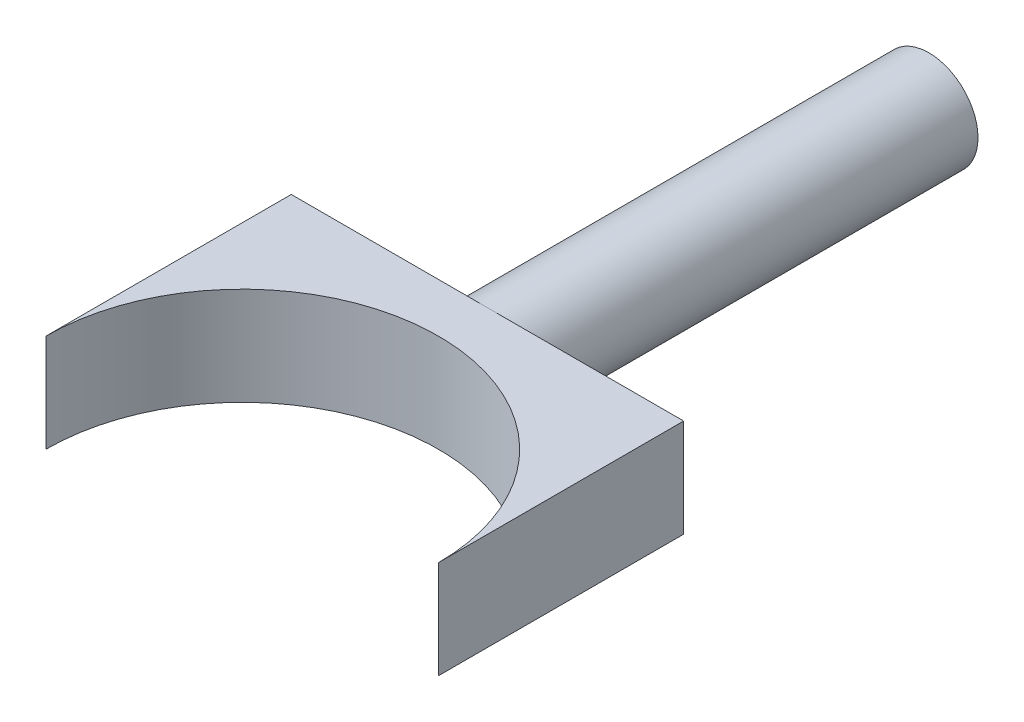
ISO-10303-21;
HEADER;
FILE_DESCRIPTION(('STEP AP214'),'2;1');
FILE_NAME('part.step','',(''),(''),'','','');
FILE_SCHEMA(('AUTOMOTIVE_DESIGN { 1 0 10303 214 1 1 1 1 }'));
ENDSEC;
DATA;
#1=APPLICATION_CONTEXT('core data for automotive mechanical design processes');
#2=APPLICATION_PROTOCOL_DEFINITION('international standard','automotive_design',2000,#1);
#3=PRODUCT_CONTEXT('',#1,'mechanical');
#4=PRODUCT('Part','Part','',(#3));
#5=PRODUCT_RELATED_PRODUCT_CATEGORY('part','',(#4));
#6=PRODUCT_DEFINITION_FORMATION('','',#4);
#7=PRODUCT_DEFINITION_CONTEXT('part definition',#1,'design');
#8=PRODUCT_DEFINITION('design','',#6,#7);
#9=PRODUCT_DEFINITION_SHAPE('','',#8);
#10=(LENGTH_UNIT() NAMED_UNIT(*) SI_UNIT(.MILLI.,.METRE.));
#11=(NAMED_UNIT(*) PLANE_ANGLE_UNIT() SI_UNIT($,.RADIAN.));
#12=(NAMED_UNIT(*) SI_UNIT($,.STERADIAN.) SOLID_ANGLE_UNIT());
#13=UNCERTAINTY_MEASURE_WITH_UNIT(LENGTH_MEASURE(1.E-05),#10,'distance_accuracy_value','');
#14=(GEOMETRIC_REPRESENTATION_CONTEXT(3) GLOBAL_UNCERTAINTY_ASSIGNED_CONTEXT((#13)) GLOBAL_UNIT_ASSIGNED_CONTEXT((#10,
#11,#12)) REPRESENTATION_CONTEXT('',''));
#15=CARTESIAN_POINT('',(0.,0.,0.));
#16=DIRECTION('',(0.,0.,1.));
#17=DIRECTION('',(1.,0.,0.));
#18=AXIS2_PLACEMENT_3D('',#15,#16,#17);
#19=CARTESIAN_POINT('',(0.,0.,45.));
#20=DIRECTION('',(0.,0.,-1.));
#21=DIRECTION('',(-1.,0.,0.));
#22=AXIS2_PLACEMENT_3D('',#19,#20,#21);
#23=CYLINDRICAL_SURFACE('',#22,5.);
#24=CARTESIAN_POINT('',(0.213209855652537,4.99545208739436,45.));
#25=DIRECTION('',(-1.,0.,0.));
#26=VECTOR('',#25,1.);
#27=LINE('',#24,#26);
#28=CARTESIAN_POINT('',(0.213209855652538,4.99545208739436,45.));
#29=VERTEX_POINT('',#28);
#30=CARTESIAN_POINT('',(-0.213209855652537,4.99545208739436,45.));
#31=VERTEX_POINT('',#30);
#32=EDGE_CURVE('E42',#29,#31,#27,.T.);
#33=ORIENTED_EDGE('',*,*,#32,.F.);
#34=CARTESIAN_POINT('',(0.,0.,45.));
#35=DIRECTION('',(0.,0.,1.));
#36=DIRECTION('',(1.,0.,0.));
#37=AXIS2_PLACEMENT_3D('',#34,#35,#36);
#38=CIRCLE('',#37,5.);
#39=CARTESIAN_POINT('',(0.213209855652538,-4.99545208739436,45.));
#40=VERTEX_POINT('',#39);
#41=EDGE_CURVE('E49',#40,#29,#38,.T.);
#42=ORIENTED_EDGE('',*,*,#41,.F.);
#43=CARTESIAN_POINT('',(-0.213209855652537,-4.99545208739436,45.));
#44=DIRECTION('',(1.,0.,0.));
#45=VECTOR('',#44,1.);
#46=LINE('',#43,#45);
#47=CARTESIAN_POINT('',(-0.213209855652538,-4.99545208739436,45.));
#48=VERTEX_POINT('',#47);
#49=EDGE_CURVE('E11',#48,#40,#46,.T.);
#50=ORIENTED_EDGE('',*,*,#49,.F.);
#51=EDGE_CURVE('E177',#31,#48,#38,.T.);
#52=ORIENTED_EDGE('',*,*,#51,.F.);
#53=EDGE_LOOP('',(#33,#42,#50,#52));
#54=FACE_BOUND('',#53,.T.);
#55=CARTESIAN_POINT('',(0.,0.,0.));
#56=DIRECTION('',(0.,0.,1.));
#57=DIRECTION('',(1.,0.,0.));
#58=AXIS2_PLACEMENT_3D('',#55,#56,#57);
#59=CIRCLE('',#58,5.);
#60=CARTESIAN_POINT('',(5.,0.,0.));
#61=VERTEX_POINT('',#60);
#62=EDGE_CURVE('E167',#61,#61,#59,.T.);
#63=ORIENTED_EDGE('',*,*,#62,.T.);
#64=EDGE_LOOP('',(#63));
#65=FACE_BOUND('',#64,.T.);
#66=ADVANCED_FACE('F32',(#54,#65),#23,.T.);
#67=CARTESIAN_POINT('',(0.,0.,0.));
#68=DIRECTION('',(0.,0.,1.));
#69=DIRECTION('',(1.,0.,0.));
#70=AXIS2_PLACEMENT_3D('',#67,#68,#69);
#71=PLANE('',#70);
#72=ORIENTED_EDGE('',*,*,#62,.F.);
#73=EDGE_LOOP('',(#72));
#74=FACE_BOUND('',#73,.T.);
#75=ADVANCED_FACE('F197',(#74),#71,.F.);
#76=CARTESIAN_POINT('',(0.,0.,45.));
#77=DIRECTION('',(0.,0.,-1.));
#78=DIRECTION('',(-1.,0.,0.));
#79=AXIS2_PLACEMENT_3D('',#76,#77,#78);
#80=PLANE('',#79);
#81=DIRECTION('',(-1.,0.,0.));
#82=VECTOR('',#81,1.);
#83=CARTESIAN_POINT('',(-20.,4.99545208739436,45.));
#84=LINE('',#83,#82);
#85=CARTESIAN_POINT('',(-20.,4.99545208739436,45.));
#86=VERTEX_POINT('',#85);
#87=EDGE_CURVE('E101',#31,#86,#84,.T.);
#88=ORIENTED_EDGE('',*,*,#87,.F.);
#89=ORIENTED_EDGE('',*,*,#51,.T.);
#90=DIRECTION('',(1.,0.,0.));
#91=VECTOR('',#90,1.);
#92=CARTESIAN_POINT('',(-20.,-4.99545208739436,45.));
#93=LINE('',#92,#91);
#94=CARTESIAN_POINT('',(-20.,-4.99545208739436,45.));
#95=VERTEX_POINT('',#94);
#96=EDGE_CURVE('E114',#95,#48,#93,.T.);
#97=ORIENTED_EDGE('',*,*,#96,.F.);
#98=DIRECTION('',(0.,-1.,0.));
#99=VECTOR('',#98,1.);
#100=CARTESIAN_POINT('',(-20.,-4.99545208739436,45.));
#101=LINE('',#100,#99);
#102=EDGE_CURVE('E123',#86,#95,#101,.T.);
#103=ORIENTED_EDGE('',*,*,#102,.F.);
#104=EDGE_LOOP('',(#88,#89,#97,#103));
#105=FACE_BOUND('',#104,.T.);
#106=ADVANCED_FACE('F195',(#105),#80,.T.);
#107=CARTESIAN_POINT('',(20.,-4.99545208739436,70.));
#108=DIRECTION('',(-1.,0.,0.));
#109=DIRECTION('',(0.,0.,1.));
#110=AXIS2_PLACEMENT_3D('',#107,#108,#109);
#111=PLANE('',#110);
#112=DIRECTION('',(0.,1.,0.));
#113=VECTOR('',#112,1.);
#114=CARTESIAN_POINT('',(20.,-4.99545208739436,45.));
#115=LINE('',#114,#113);
#116=CARTESIAN_POINT('',(20.,-4.99545208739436,45.));
#117=VERTEX_POINT('',#116);
#118=CARTESIAN_POINT('',(20.,4.99545208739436,45.));
#119=VERTEX_POINT('',#118);
#120=EDGE_CURVE('E118',#117,#119,#115,.T.);
#121=ORIENTED_EDGE('',*,*,#120,.T.);
#122=DIRECTION('',(0.,0.,-1.));
#123=VECTOR('',#122,1.);
#124=CARTESIAN_POINT('',(20.,4.99545208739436,70.));
#125=LINE('',#124,#123);
#126=CARTESIAN_POINT('',(20.,4.99545208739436,70.));
#127=VERTEX_POINT('',#126);
#128=EDGE_CURVE('E104',#127,#119,#125,.T.);
#129=ORIENTED_EDGE('',*,*,#128,.F.);
#130=DIRECTION('',(0.,1.,0.));
#131=VECTOR('',#130,1.);
#132=CARTESIAN_POINT('',(20.,-4.99545208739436,70.));
#133=LINE('',#132,#131);
#134=CARTESIAN_POINT('',(20.,-4.99545208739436,70.));
#135=VERTEX_POINT('',#134);
#136=EDGE_CURVE('E90',#135,#127,#133,.T.);
#137=ORIENTED_EDGE('',*,*,#136,.F.);
#138=DIRECTION('',(0.,0.,-1.));
#139=VECTOR('',#138,1.);
#140=CARTESIAN_POINT('',(20.,-4.99545208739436,70.));
#141=LINE('',#140,#139);
#142=EDGE_CURVE('E110',#135,#117,#141,.T.);
#143=ORIENTED_EDGE('',*,*,#142,.T.);
#144=EDGE_LOOP('',(#121,#129,#137,#143));
#145=FACE_BOUND('',#144,.T.);
#146=ADVANCED_FACE('F156',(#145),#111,.F.);
#147=CARTESIAN_POINT('',(-20.,4.99545208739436,70.));
#148=DIRECTION('',(0.,-1.,0.));
#149=DIRECTION('',(0.,0.,-1.));
#150=AXIS2_PLACEMENT_3D('',#147,#148,#149);
#151=PLANE('',#150);
#152=DIRECTION('',(0.,0.,-1.));
#153=VECTOR('',#152,1.);
#154=CARTESIAN_POINT('',(-20.,4.99545208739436,70.));
#155=LINE('',#154,#153);
#156=CARTESIAN_POINT('',(-20.,4.99545208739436,70.));
#157=VERTEX_POINT('',#156);
#158=EDGE_CURVE('E97',#157,#86,#155,.T.);
#159=ORIENTED_EDGE('',*,*,#158,.F.);
#160=CARTESIAN_POINT('',(0.,4.99545208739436,70.));
#161=DIRECTION('',(0.,1.,0.));
#162=DIRECTION('',(0.,0.,1.));
#163=AXIS2_PLACEMENT_3D('',#160,#161,#162);
#164=CIRCLE('',#163,20.);
#165=EDGE_CURVE('E83',#127,#157,#164,.T.);
#166=ORIENTED_EDGE('',*,*,#165,.F.);
#167=ORIENTED_EDGE('',*,*,#128,.T.);
#168=EDGE_CURVE('E127',#119,#29,#84,.T.);
#169=ORIENTED_EDGE('',*,*,#168,.T.);
#170=ORIENTED_EDGE('',*,*,#32,.T.);
#171=ORIENTED_EDGE('',*,*,#87,.T.);
#172=EDGE_LOOP('',(#159,#166,#167,#169,#170,#171));
#173=FACE_BOUND('',#172,.T.);
#174=ADVANCED_FACE('F98',(#173),#151,.F.);
#175=CARTESIAN_POINT('',(-20.,-4.99545208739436,70.));
#176=DIRECTION('',(1.,0.,0.));
#177=DIRECTION('',(0.,0.,-1.));
#178=AXIS2_PLACEMENT_3D('',#175,#176,#177);
#179=PLANE('',#178);
#180=ORIENTED_EDGE('',*,*,#102,.T.);
#181=DIRECTION('',(0.,0.,-1.));
#182=VECTOR('',#181,1.);
#183=CARTESIAN_POINT('',(-20.,-4.99545208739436,70.));
#184=LINE('',#183,#182);
#185=CARTESIAN_POINT('',(-20.,-4.99545208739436,70.));
#186=VERTEX_POINT('',#185);
#187=EDGE_CURVE('E105',#186,#95,#184,.T.);
#188=ORIENTED_EDGE('',*,*,#187,.F.);
#189=DIRECTION('',(0.,-1.,0.));
#190=VECTOR('',#189,1.);
#191=CARTESIAN_POINT('',(-20.,-4.99545208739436,70.));
#192=LINE('',#191,#190);
#193=EDGE_CURVE('E87',#157,#186,#192,.T.);
#194=ORIENTED_EDGE('',*,*,#193,.F.);
#195=ORIENTED_EDGE('',*,*,#158,.T.);
#196=EDGE_LOOP('',(#180,#188,#194,#195));
#197=FACE_BOUND('',#196,.T.);
#198=ADVANCED_FACE('F108',(#197),#179,.F.);
#199=CARTESIAN_POINT('',(-20.,-4.99545208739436,70.));
#200=DIRECTION('',(0.,1.,0.));
#201=DIRECTION('',(0.,0.,1.));
#202=AXIS2_PLACEMENT_3D('',#199,#200,#201);
#203=PLANE('',#202);
#204=ORIENTED_EDGE('',*,*,#142,.F.);
#205=CARTESIAN_POINT('',(0.,-4.99545208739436,70.));
#206=DIRECTION('',(0.,1.,0.));
#207=DIRECTION('',(0.,0.,1.));
#208=AXIS2_PLACEMENT_3D('',#205,#206,#207);
#209=CIRCLE('',#208,20.);
#210=EDGE_CURVE('E94',#135,#186,#209,.T.);
#211=ORIENTED_EDGE('',*,*,#210,.T.);
#212=ORIENTED_EDGE('',*,*,#187,.T.);
#213=ORIENTED_EDGE('',*,*,#96,.T.);
#214=ORIENTED_EDGE('',*,*,#49,.T.);
#215=EDGE_CURVE('E171',#40,#117,#93,.T.);
#216=ORIENTED_EDGE('',*,*,#215,.T.);
#217=EDGE_LOOP('',(#204,#211,#212,#213,#214,#216));
#218=FACE_BOUND('',#217,.T.);
#219=ADVANCED_FACE('F139',(#218),#203,.F.);
#220=ORIENTED_EDGE('',*,*,#215,.F.);
#221=ORIENTED_EDGE('',*,*,#41,.T.);
#222=ORIENTED_EDGE('',*,*,#168,.F.);
#223=ORIENTED_EDGE('',*,*,#120,.F.);
#224=EDGE_LOOP('',(#220,#221,#222,#223));
#225=FACE_BOUND('',#224,.T.);
#226=ADVANCED_FACE('F149',(#225),#80,.T.);
#227=CARTESIAN_POINT('',(0.,-5.02942928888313,70.));
#228=DIRECTION('',(0.,1.,0.));
#229=DIRECTION('',(0.,0.,1.));
#230=AXIS2_PLACEMENT_3D('',#227,#228,#229);
#231=CYLINDRICAL_SURFACE('',#230,20.);
#232=ORIENTED_EDGE('',*,*,#136,.T.);
#233=ORIENTED_EDGE('',*,*,#165,.T.);
#234=ORIENTED_EDGE('',*,*,#193,.T.);
#235=ORIENTED_EDGE('',*,*,#210,.F.);
#236=EDGE_LOOP('',(#232,#233,#234,#235));
#237=FACE_BOUND('',#236,.T.);
#238=ADVANCED_FACE('F85',(#237),#231,.F.);
#239=CLOSED_SHELL('',(#66,#75,#106,#146,#174,#198,#219,#226,#238));
#240=MANIFOLD_SOLID_BREP('B2',#239);
#241=ADVANCED_BREP_SHAPE_REPRESENTATION('',(#18,#240),#14);
#242=SHAPE_DEFINITION_REPRESENTATION(#9,#241);
ENDSEC;
END-ISO-10303-21;
